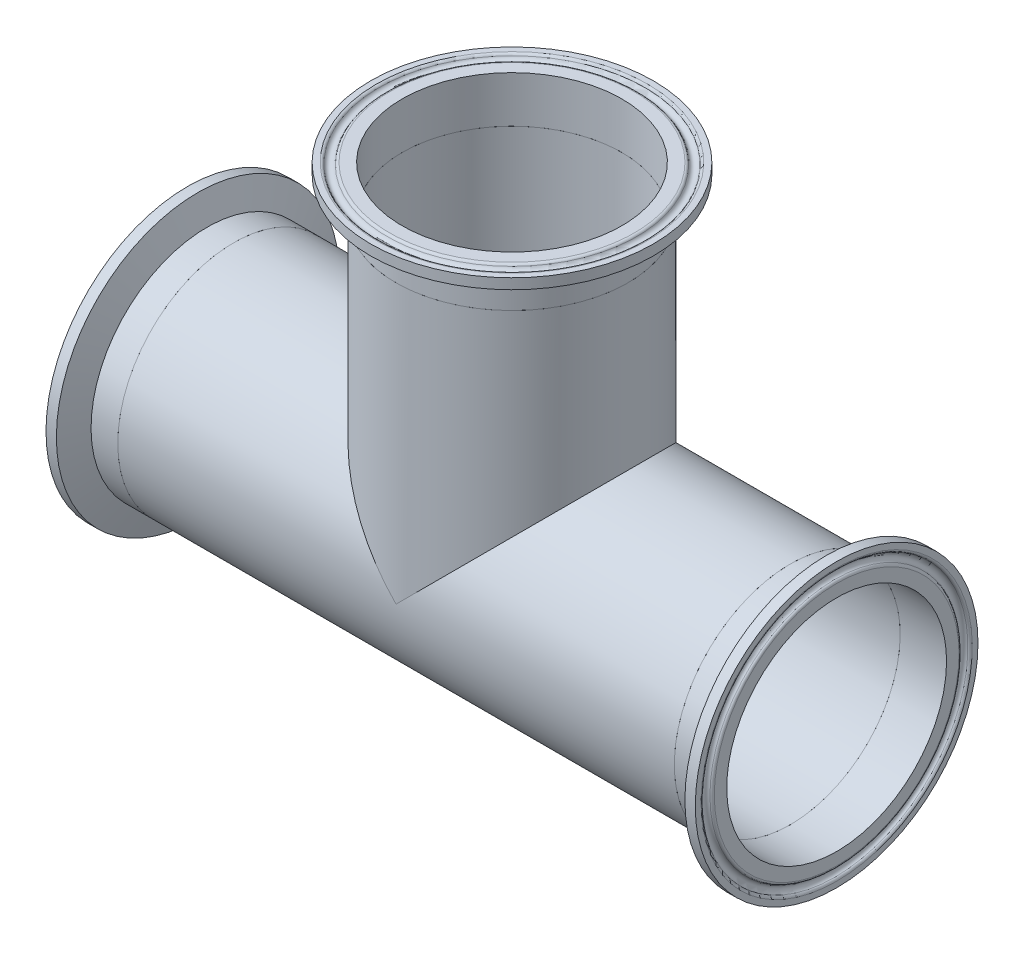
ISO-10303-21;
HEADER;
FILE_DESCRIPTION(('STEP AP214'),'2;1');
FILE_NAME('part.step','',(''),(''),'','','');
FILE_SCHEMA(('AUTOMOTIVE_DESIGN { 1 0 10303 214 1 1 1 1 }'));
ENDSEC;
DATA;
#1=APPLICATION_CONTEXT('core data for automotive mechanical design processes');
#2=APPLICATION_PROTOCOL_DEFINITION('international standard','automotive_design',2000,#1);
#3=PRODUCT_CONTEXT('',#1,'mechanical');
#4=PRODUCT('Part','Part','',(#3));
#5=PRODUCT_RELATED_PRODUCT_CATEGORY('part','',(#4));
#6=PRODUCT_DEFINITION_FORMATION('','',#4);
#7=PRODUCT_DEFINITION_CONTEXT('part definition',#1,'design');
#8=PRODUCT_DEFINITION('design','',#6,#7);
#9=PRODUCT_DEFINITION_SHAPE('','',#8);
#10=(LENGTH_UNIT() NAMED_UNIT(*) SI_UNIT(.MILLI.,.METRE.));
#11=(NAMED_UNIT(*) PLANE_ANGLE_UNIT() SI_UNIT($,.RADIAN.));
#12=(NAMED_UNIT(*) SI_UNIT($,.STERADIAN.) SOLID_ANGLE_UNIT());
#13=UNCERTAINTY_MEASURE_WITH_UNIT(LENGTH_MEASURE(1.E-05),#10,'distance_accuracy_value','');
#14=(GEOMETRIC_REPRESENTATION_CONTEXT(3) GLOBAL_UNCERTAINTY_ASSIGNED_CONTEXT((#13)) GLOBAL_UNIT_ASSIGNED_CONTEXT((#10,
#11,#12)) REPRESENTATION_CONTEXT('',''));
#15=CARTESIAN_POINT('',(0.,0.,0.));
#16=DIRECTION('',(0.,0.,1.));
#17=DIRECTION('',(1.,0.,0.));
#18=AXIS2_PLACEMENT_3D('',#15,#16,#17);
#19=CARTESIAN_POINT('',(47.9033136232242,153.550858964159,131.294687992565));
#20=DIRECTION('',(0.,1.00000000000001,0.));
#21=DIRECTION('',(-0.631074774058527,0.,-0.775722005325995));
#22=AXIS2_PLACEMENT_3D('',#19,#20,#21);
#23=TOROIDAL_SURFACE('',#22,37.1367084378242,0.787400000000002);
#24=CARTESIAN_POINT('',(47.9033136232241,154.33825896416,131.294687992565));
#25=DIRECTION('',(0.,1.00000000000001,0.));
#26=DIRECTION('',(-0.631074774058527,0.,-0.775722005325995));
#27=AXIS2_PLACEMENT_3D('',#24,#25,#26);
#28=CIRCLE('',#27,37.1367084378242);
#29=CARTESIAN_POINT('',(24.4672737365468,154.33825896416,102.48692605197));
#30=VERTEX_POINT('',#29);
#31=EDGE_CURVE('P0_E48',#30,#30,#28,.T.);
#32=ORIENTED_EDGE('',*,*,#31,.T.);
#33=EDGE_LOOP('',(#32));
#34=FACE_BOUND('',#33,.T.);
#35=CARTESIAN_POINT('',(47.9033136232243,153.863799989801,131.294687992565));
#36=DIRECTION('',(0.,1.00000000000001,0.));
#37=DIRECTION('',(-0.631074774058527,0.,-0.775722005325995));
#38=AXIS2_PLACEMENT_3D('',#35,#36,#37);
#39=CIRCLE('',#38,36.4141666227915);
#40=CARTESIAN_POINT('',(24.9232516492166,153.863799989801,103.047417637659));
#41=VERTEX_POINT('',#40);
#42=EDGE_CURVE('P0_E9',#41,#41,#39,.T.);
#43=ORIENTED_EDGE('',*,*,#42,.F.);
#44=EDGE_LOOP('',(#43));
#45=FACE_BOUND('',#44,.T.);
#46=ADVANCED_FACE('P0_F14',(#34,#45),#23,.T.);
#47=CARTESIAN_POINT('',(47.9033136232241,154.33825896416,131.294687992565));
#48=DIRECTION('',(0.,1.00000000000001,0.));
#49=DIRECTION('',(-0.631074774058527,0.,-0.775722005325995));
#50=AXIS2_PLACEMENT_3D('',#47,#48,#49);
#51=TOROIDAL_SURFACE('',#50,35.3187,1.1938);
#52=CARTESIAN_POINT('',(47.9033136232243,153.863799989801,131.294687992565));
#53=DIRECTION('',(0.,1.00000000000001,0.));
#54=DIRECTION('',(-0.631074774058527,0.,-0.775722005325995));
#55=AXIS2_PLACEMENT_3D('',#52,#53,#54);
#56=CIRCLE('',#55,34.2232333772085);
#57=CARTESIAN_POINT('',(26.3058943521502,153.863799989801,104.746972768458));
#58=VERTEX_POINT('',#57);
#59=EDGE_CURVE('P0_E20',#58,#58,#56,.T.);
#60=ORIENTED_EDGE('',*,*,#59,.F.);
#61=EDGE_LOOP('',(#60));
#62=FACE_BOUND('',#61,.T.);
#63=ORIENTED_EDGE('',*,*,#42,.T.);
#64=EDGE_LOOP('',(#63));
#65=FACE_BOUND('',#64,.T.);
#66=ADVANCED_FACE('P0_F97',(#62,#65),#51,.F.);
#67=CARTESIAN_POINT('',(47.9033136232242,153.550858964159,131.294687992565));
#68=DIRECTION('',(0.,1.00000000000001,0.));
#69=DIRECTION('',(-0.631074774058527,0.,-0.775722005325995));
#70=AXIS2_PLACEMENT_3D('',#67,#68,#69);
#71=TOROIDAL_SURFACE('',#70,33.5006915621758,0.787399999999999);
#72=ORIENTED_EDGE('',*,*,#59,.T.);
#73=EDGE_LOOP('',(#72));
#74=FACE_BOUND('',#73,.T.);
#75=CARTESIAN_POINT('',(47.9033136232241,154.33825896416,131.294687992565));
#76=DIRECTION('',(0.,1.00000000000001,0.));
#77=DIRECTION('',(-0.631074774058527,0.,-0.775722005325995));
#78=AXIS2_PLACEMENT_3D('',#75,#76,#77);
#79=CIRCLE('',#78,33.5006915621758);
#80=CARTESIAN_POINT('',(26.7618722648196,154.33825896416,105.307464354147));
#81=VERTEX_POINT('',#80);
#82=EDGE_CURVE('P0_E24',#81,#81,#79,.T.);
#83=ORIENTED_EDGE('',*,*,#82,.F.);
#84=EDGE_LOOP('',(#83));
#85=FACE_BOUND('',#84,.T.);
#86=ADVANCED_FACE('P0_F93',(#74,#85),#71,.T.);
#87=CARTESIAN_POINT('',(47.9033136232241,154.33825896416,131.294687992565));
#88=DIRECTION('',(0.,-1.00000000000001,0.));
#89=DIRECTION('',(0.631074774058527,0.,0.775722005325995));
#90=AXIS2_PLACEMENT_3D('',#87,#88,#89);
#91=PLANE('',#90);
#92=CARTESIAN_POINT('',(47.9033136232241,154.33825896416,131.294687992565));
#93=DIRECTION('',(0.,1.00000000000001,0.));
#94=DIRECTION('',(-0.631074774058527,0.,-0.775722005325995));
#95=AXIS2_PLACEMENT_3D('',#92,#93,#94);
#96=CIRCLE('',#95,30.099);
#97=CARTESIAN_POINT('',(28.9085939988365,154.33825896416,107.946231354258));
#98=VERTEX_POINT('',#97);
#99=EDGE_CURVE('P0_E28',#98,#98,#96,.T.);
#100=ORIENTED_EDGE('',*,*,#99,.F.);
#101=EDGE_LOOP('',(#100));
#102=FACE_BOUND('',#101,.T.);
#103=ORIENTED_EDGE('',*,*,#82,.T.);
#104=EDGE_LOOP('',(#103));
#105=FACE_BOUND('',#104,.T.);
#106=ADVANCED_FACE('P0_F86',(#102,#105),#91,.F.);
#107=CARTESIAN_POINT('',(47.9033136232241,154.33825896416,131.294687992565));
#108=DIRECTION('',(0.,1.00000000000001,0.));
#109=DIRECTION('',(-0.631074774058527,0.,-0.775722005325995));
#110=AXIS2_PLACEMENT_3D('',#107,#108,#109);
#111=CYLINDRICAL_SURFACE('',#110,30.099);
#112=ORIENTED_EDGE('',*,*,#99,.T.);
#113=EDGE_LOOP('',(#112));
#114=FACE_BOUND('',#113,.T.);
#115=CARTESIAN_POINT('',(47.9033136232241,141.638258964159,131.294687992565));
#116=DIRECTION('',(0.,1.00000000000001,0.));
#117=DIRECTION('',(-0.631074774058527,0.,-0.775722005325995));
#118=AXIS2_PLACEMENT_3D('',#115,#116,#117);
#119=CIRCLE('',#118,30.099);
#120=CARTESIAN_POINT('',(28.9085939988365,141.63825896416,107.946231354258));
#121=VERTEX_POINT('',#120);
#122=EDGE_CURVE('P0_E33',#121,#121,#119,.T.);
#123=ORIENTED_EDGE('',*,*,#122,.F.);
#124=EDGE_LOOP('',(#123));
#125=FACE_BOUND('',#124,.T.);
#126=ADVANCED_FACE('P0_F81',(#114,#125),#111,.F.);
#127=CARTESIAN_POINT('',(47.9033136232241,141.638258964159,131.294687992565));
#128=DIRECTION('',(0.,1.00000000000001,0.));
#129=DIRECTION('',(-0.631074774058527,0.,-0.775722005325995));
#130=AXIS2_PLACEMENT_3D('',#127,#128,#129);
#131=PLANE('',#130);
#132=CARTESIAN_POINT('',(47.9033136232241,141.638258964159,131.294687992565));
#133=DIRECTION('',(0.,1.00000000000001,0.));
#134=DIRECTION('',(-0.631074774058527,0.,-0.775722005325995));
#135=AXIS2_PLACEMENT_3D('',#132,#133,#134);
#136=CIRCLE('',#135,31.75);
#137=CARTESIAN_POINT('',(27.8666895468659,141.63825896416,106.665514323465));
#138=VERTEX_POINT('',#137);
#139=EDGE_CURVE('P0_E36',#138,#138,#136,.T.);
#140=ORIENTED_EDGE('',*,*,#139,.F.);
#141=EDGE_LOOP('',(#140));
#142=FACE_BOUND('',#141,.T.);
#143=ORIENTED_EDGE('',*,*,#122,.T.);
#144=EDGE_LOOP('',(#143));
#145=FACE_BOUND('',#144,.T.);
#146=ADVANCED_FACE('P0_F75',(#142,#145),#131,.F.);
#147=CARTESIAN_POINT('',(47.9033136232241,154.33825896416,131.294687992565));
#148=DIRECTION('',(0.,1.00000000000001,0.));
#149=DIRECTION('',(-0.631074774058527,0.,-0.775722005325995));
#150=AXIS2_PLACEMENT_3D('',#147,#148,#149);
#151=CYLINDRICAL_SURFACE('',#150,31.75);
#152=CARTESIAN_POINT('',(47.903313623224,148.96037172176,131.294687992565));
#153=DIRECTION('',(0.,1.00000000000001,0.));
#154=DIRECTION('',(-0.631074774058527,0.,-0.775722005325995));
#155=AXIS2_PLACEMENT_3D('',#152,#153,#154);
#156=CIRCLE('',#155,31.75);
#157=CARTESIAN_POINT('',(27.8666895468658,148.96037172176,106.665514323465));
#158=VERTEX_POINT('',#157);
#159=EDGE_CURVE('P0_E39',#158,#158,#156,.T.);
#160=ORIENTED_EDGE('',*,*,#159,.F.);
#161=EDGE_LOOP('',(#160));
#162=FACE_BOUND('',#161,.T.);
#163=ORIENTED_EDGE('',*,*,#139,.T.);
#164=EDGE_LOOP('',(#163));
#165=FACE_BOUND('',#164,.T.);
#166=ADVANCED_FACE('P0_F69',(#162,#165),#151,.T.);
#167=CARTESIAN_POINT('',(47.903313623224,148.96037172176,131.294687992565));
#168=DIRECTION('',(0.,1.00000000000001,0.));
#169=DIRECTION('',(-0.631074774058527,0.,-0.775722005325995));
#170=AXIS2_PLACEMENT_3D('',#167,#168,#169);
#171=CONICAL_SURFACE('',#170,31.75,1.22173047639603);
#172=CARTESIAN_POINT('',(47.9033136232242,151.493458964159,131.294687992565));
#173=DIRECTION('',(0.,1.00000000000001,0.));
#174=DIRECTION('',(-0.631074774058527,0.,-0.775722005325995));
#175=AXIS2_PLACEMENT_3D('',#172,#173,#174);
#176=CIRCLE('',#175,38.7096);
#177=CARTESIAN_POINT('',(23.4746615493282,151.49345896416,101.266799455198));
#178=VERTEX_POINT('',#177);
#179=EDGE_CURVE('P0_E42',#178,#178,#176,.T.);
#180=ORIENTED_EDGE('',*,*,#179,.F.);
#181=EDGE_LOOP('',(#180));
#182=FACE_BOUND('',#181,.T.);
#183=ORIENTED_EDGE('',*,*,#159,.T.);
#184=EDGE_LOOP('',(#183));
#185=FACE_BOUND('',#184,.T.);
#186=ADVANCED_FACE('P0_F63',(#182,#185),#171,.T.);
#187=CARTESIAN_POINT('',(47.9033136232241,154.33825896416,131.294687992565));
#188=DIRECTION('',(0.,1.00000000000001,0.));
#189=DIRECTION('',(-0.631074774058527,0.,-0.775722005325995));
#190=AXIS2_PLACEMENT_3D('',#187,#188,#189);
#191=CYLINDRICAL_SURFACE('',#190,38.7096);
#192=CARTESIAN_POINT('',(47.9033136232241,154.33825896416,131.294687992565));
#193=DIRECTION('',(0.,1.00000000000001,0.));
#194=DIRECTION('',(-0.631074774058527,0.,-0.775722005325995));
#195=AXIS2_PLACEMENT_3D('',#192,#193,#194);
#196=CIRCLE('',#195,38.7096);
#197=CARTESIAN_POINT('',(23.4746615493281,154.33825896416,101.266799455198));
#198=VERTEX_POINT('',#197);
#199=EDGE_CURVE('P0_E45',#198,#198,#196,.T.);
#200=ORIENTED_EDGE('',*,*,#199,.F.);
#201=EDGE_LOOP('',(#200));
#202=FACE_BOUND('',#201,.T.);
#203=ORIENTED_EDGE('',*,*,#179,.T.);
#204=EDGE_LOOP('',(#203));
#205=FACE_BOUND('',#204,.T.);
#206=ADVANCED_FACE('P0_F57',(#202,#205),#191,.T.);
#207=CARTESIAN_POINT('',(47.9033136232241,154.33825896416,131.294687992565));
#208=DIRECTION('',(0.,-1.00000000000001,0.));
#209=DIRECTION('',(0.631074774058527,0.,0.775722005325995));
#210=AXIS2_PLACEMENT_3D('',#207,#208,#209);
#211=PLANE('',#210);
#212=ORIENTED_EDGE('',*,*,#31,.F.);
#213=EDGE_LOOP('',(#212));
#214=FACE_BOUND('',#213,.T.);
#215=ORIENTED_EDGE('',*,*,#199,.T.);
#216=EDGE_LOOP('',(#215));
#217=FACE_BOUND('',#216,.T.);
#218=ADVANCED_FACE('P0_F54',(#214,#217),#211,.F.);
#219=CLOSED_SHELL('',(#46,#66,#86,#106,#126,#146,#166,#186,#206,#218));
#220=MANIFOLD_SOLID_BREP('P0_B1',#219);
#221=CARTESIAN_POINT('',(136.015913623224,65.4382589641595,131.294687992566));
#222=DIRECTION('',(1.00000000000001,0.,0.));
#223=DIRECTION('',(0.,-0.994854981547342,0.101309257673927));
#224=AXIS2_PLACEMENT_3D('',#221,#222,#223);
#225=TOROIDAL_SURFACE('',#224,37.1367084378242,0.787400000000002);
#226=CARTESIAN_POINT('',(136.803313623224,65.4382589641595,131.294687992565));
#227=DIRECTION('',(1.00000000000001,0.,0.));
#228=DIRECTION('',(0.,-0.994854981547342,0.101309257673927));
#229=AXIS2_PLACEMENT_3D('',#226,#227,#228);
#230=CIRCLE('',#229,37.1367084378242);
#231=CARTESIAN_POINT('',(136.803313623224,28.4926195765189,135.056980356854));
#232=VERTEX_POINT('',#231);
#233=EDGE_CURVE('P1_E49',#232,#232,#230,.T.);
#234=ORIENTED_EDGE('',*,*,#233,.T.);
#235=EDGE_LOOP('',(#234));
#236=FACE_BOUND('',#235,.T.);
#237=CARTESIAN_POINT('',(136.328854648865,65.4382589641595,131.294687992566));
#238=DIRECTION('',(1.00000000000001,0.,0.));
#239=DIRECTION('',(0.,-0.994854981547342,0.101309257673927));
#240=AXIS2_PLACEMENT_3D('',#237,#238,#239);
#241=CIRCLE('',#240,36.4141666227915);
#242=CARTESIAN_POINT('',(136.328854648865,29.2114439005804,134.983780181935));
#243=VERTEX_POINT('',#242);
#244=EDGE_CURVE('P1_E10',#243,#243,#241,.T.);
#245=ORIENTED_EDGE('',*,*,#244,.F.);
#246=EDGE_LOOP('',(#245));
#247=FACE_BOUND('',#246,.T.);
#248=ADVANCED_FACE('P1_F15',(#236,#247),#225,.T.);
#249=CARTESIAN_POINT('',(136.803313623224,65.4382589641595,131.294687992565));
#250=DIRECTION('',(1.00000000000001,0.,0.));
#251=DIRECTION('',(0.,-0.994854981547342,0.101309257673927));
#252=AXIS2_PLACEMENT_3D('',#249,#250,#251);
#253=TOROIDAL_SURFACE('',#252,35.3187,1.1938);
#254=CARTESIAN_POINT('',(136.328854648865,65.4382589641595,131.294687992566));
#255=DIRECTION('',(1.00000000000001,0.,0.));
#256=DIRECTION('',(0.,-0.994854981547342,0.101309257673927));
#257=AXIS2_PLACEMENT_3D('',#254,#255,#256);
#258=CIRCLE('',#257,34.2232333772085);
#259=CARTESIAN_POINT('',(136.328854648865,31.3911047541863,134.761818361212));
#260=VERTEX_POINT('',#259);
#261=EDGE_CURVE('P1_E21',#260,#260,#258,.T.);
#262=ORIENTED_EDGE('',*,*,#261,.F.);
#263=EDGE_LOOP('',(#262));
#264=FACE_BOUND('',#263,.T.);
#265=ORIENTED_EDGE('',*,*,#244,.T.);
#266=EDGE_LOOP('',(#265));
#267=FACE_BOUND('',#266,.T.);
#268=ADVANCED_FACE('P1_F98',(#264,#267),#253,.F.);
#269=CARTESIAN_POINT('',(136.015913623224,65.4382589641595,131.294687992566));
#270=DIRECTION('',(1.00000000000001,0.,0.));
#271=DIRECTION('',(0.,-0.994854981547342,0.101309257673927));
#272=AXIS2_PLACEMENT_3D('',#269,#270,#271);
#273=TOROIDAL_SURFACE('',#272,33.5006915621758,0.787399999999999);
#274=ORIENTED_EDGE('',*,*,#261,.T.);
#275=EDGE_LOOP('',(#274));
#276=FACE_BOUND('',#275,.T.);
#277=CARTESIAN_POINT('',(136.803313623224,65.4382589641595,131.294687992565));
#278=DIRECTION('',(1.00000000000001,0.,0.));
#279=DIRECTION('',(0.,-0.994854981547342,0.101309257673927));
#280=AXIS2_PLACEMENT_3D('',#277,#278,#279);
#281=CIRCLE('',#280,33.5006915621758);
#282=CARTESIAN_POINT('',(136.803313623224,32.1099290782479,134.688618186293));
#283=VERTEX_POINT('',#282);
#284=EDGE_CURVE('P1_E25',#283,#283,#281,.T.);
#285=ORIENTED_EDGE('',*,*,#284,.F.);
#286=EDGE_LOOP('',(#285));
#287=FACE_BOUND('',#286,.T.);
#288=ADVANCED_FACE('P1_F94',(#276,#287),#273,.T.);
#289=CARTESIAN_POINT('',(136.803313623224,65.4382589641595,131.294687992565));
#290=DIRECTION('',(-1.00000000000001,0.,0.));
#291=DIRECTION('',(0.,0.994854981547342,-0.101309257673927));
#292=AXIS2_PLACEMENT_3D('',#289,#290,#291);
#293=PLANE('',#292);
#294=CARTESIAN_POINT('',(136.803313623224,65.4382589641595,131.294687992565));
#295=DIRECTION('',(1.00000000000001,0.,0.));
#296=DIRECTION('',(0.,-0.994854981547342,0.101309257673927));
#297=AXIS2_PLACEMENT_3D('',#294,#295,#296);
#298=CIRCLE('',#297,30.099);
#299=CARTESIAN_POINT('',(136.803313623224,35.494118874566,134.343995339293));
#300=VERTEX_POINT('',#299);
#301=EDGE_CURVE('P1_E29',#300,#300,#298,.T.);
#302=ORIENTED_EDGE('',*,*,#301,.F.);
#303=EDGE_LOOP('',(#302));
#304=FACE_BOUND('',#303,.T.);
#305=ORIENTED_EDGE('',*,*,#284,.T.);
#306=EDGE_LOOP('',(#305));
#307=FACE_BOUND('',#306,.T.);
#308=ADVANCED_FACE('P1_F87',(#304,#307),#293,.F.);
#309=CARTESIAN_POINT('',(136.803313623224,65.4382589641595,131.294687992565));
#310=DIRECTION('',(1.00000000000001,0.,0.));
#311=DIRECTION('',(0.,-0.994854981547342,0.101309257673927));
#312=AXIS2_PLACEMENT_3D('',#309,#310,#311);
#313=CYLINDRICAL_SURFACE('',#312,30.099);
#314=ORIENTED_EDGE('',*,*,#301,.T.);
#315=EDGE_LOOP('',(#314));
#316=FACE_BOUND('',#315,.T.);
#317=CARTESIAN_POINT('',(124.103313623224,65.4382589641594,131.294687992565));
#318=DIRECTION('',(1.00000000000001,0.,0.));
#319=DIRECTION('',(0.,-0.994854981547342,0.101309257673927));
#320=AXIS2_PLACEMENT_3D('',#317,#318,#319);
#321=CIRCLE('',#320,30.099);
#322=CARTESIAN_POINT('',(124.103313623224,35.494118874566,134.343995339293));
#323=VERTEX_POINT('',#322);
#324=EDGE_CURVE('P1_E34',#323,#323,#321,.T.);
#325=ORIENTED_EDGE('',*,*,#324,.F.);
#326=EDGE_LOOP('',(#325));
#327=FACE_BOUND('',#326,.T.);
#328=ADVANCED_FACE('P1_F82',(#316,#327),#313,.F.);
#329=CARTESIAN_POINT('',(124.103313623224,65.4382589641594,131.294687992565));
#330=DIRECTION('',(1.00000000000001,0.,0.));
#331=DIRECTION('',(0.,-0.994854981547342,0.101309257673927));
#332=AXIS2_PLACEMENT_3D('',#329,#330,#331);
#333=PLANE('',#332);
#334=CARTESIAN_POINT('',(124.103313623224,65.4382589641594,131.294687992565));
#335=DIRECTION('',(1.00000000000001,0.,0.));
#336=DIRECTION('',(0.,-0.994854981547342,0.101309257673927));
#337=AXIS2_PLACEMENT_3D('',#334,#335,#336);
#338=CIRCLE('',#337,31.75);
#339=CARTESIAN_POINT('',(124.103313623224,33.8516133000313,134.511256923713));
#340=VERTEX_POINT('',#339);
#341=EDGE_CURVE('P1_E37',#340,#340,#338,.T.);
#342=ORIENTED_EDGE('',*,*,#341,.F.);
#343=EDGE_LOOP('',(#342));
#344=FACE_BOUND('',#343,.T.);
#345=ORIENTED_EDGE('',*,*,#324,.T.);
#346=EDGE_LOOP('',(#345));
#347=FACE_BOUND('',#346,.T.);
#348=ADVANCED_FACE('P1_F76',(#344,#347),#333,.F.);
#349=CARTESIAN_POINT('',(136.803313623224,65.4382589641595,131.294687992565));
#350=DIRECTION('',(1.00000000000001,0.,0.));
#351=DIRECTION('',(0.,-0.994854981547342,0.101309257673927));
#352=AXIS2_PLACEMENT_3D('',#349,#350,#351);
#353=CYLINDRICAL_SURFACE('',#352,31.75);
#354=CARTESIAN_POINT('',(131.425426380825,65.4382589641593,131.294687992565));
#355=DIRECTION('',(1.00000000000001,0.,0.));
#356=DIRECTION('',(0.,-0.994854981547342,0.101309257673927));
#357=AXIS2_PLACEMENT_3D('',#354,#355,#356);
#358=CIRCLE('',#357,31.75);
#359=CARTESIAN_POINT('',(131.425426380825,33.8516133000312,134.511256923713));
#360=VERTEX_POINT('',#359);
#361=EDGE_CURVE('P1_E40',#360,#360,#358,.T.);
#362=ORIENTED_EDGE('',*,*,#361,.F.);
#363=EDGE_LOOP('',(#362));
#364=FACE_BOUND('',#363,.T.);
#365=ORIENTED_EDGE('',*,*,#341,.T.);
#366=EDGE_LOOP('',(#365));
#367=FACE_BOUND('',#366,.T.);
#368=ADVANCED_FACE('P1_F70',(#364,#367),#353,.T.);
#369=CARTESIAN_POINT('',(131.425426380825,65.4382589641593,131.294687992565));
#370=DIRECTION('',(1.00000000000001,0.,0.));
#371=DIRECTION('',(0.,-0.994854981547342,0.101309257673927));
#372=AXIS2_PLACEMENT_3D('',#369,#370,#371);
#373=CONICAL_SURFACE('',#372,31.75,1.22173047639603);
#374=CARTESIAN_POINT('',(133.958513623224,65.4382589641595,131.294687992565));
#375=DIRECTION('',(1.00000000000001,0.,0.));
#376=DIRECTION('',(0.,-0.994854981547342,0.101309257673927));
#377=AXIS2_PLACEMENT_3D('',#374,#375,#376);
#378=CIRCLE('',#377,38.7096);
#379=CARTESIAN_POINT('',(133.958513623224,26.9278205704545,135.21632883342));
#380=VERTEX_POINT('',#379);
#381=EDGE_CURVE('P1_E43',#380,#380,#378,.T.);
#382=ORIENTED_EDGE('',*,*,#381,.F.);
#383=EDGE_LOOP('',(#382));
#384=FACE_BOUND('',#383,.T.);
#385=ORIENTED_EDGE('',*,*,#361,.T.);
#386=EDGE_LOOP('',(#385));
#387=FACE_BOUND('',#386,.T.);
#388=ADVANCED_FACE('P1_F64',(#384,#387),#373,.T.);
#389=CARTESIAN_POINT('',(136.803313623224,65.4382589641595,131.294687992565));
#390=DIRECTION('',(1.00000000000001,0.,0.));
#391=DIRECTION('',(0.,-0.994854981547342,0.101309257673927));
#392=AXIS2_PLACEMENT_3D('',#389,#390,#391);
#393=CYLINDRICAL_SURFACE('',#392,38.7096);
#394=CARTESIAN_POINT('',(136.803313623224,65.4382589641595,131.294687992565));
#395=DIRECTION('',(1.00000000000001,0.,0.));
#396=DIRECTION('',(0.,-0.994854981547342,0.101309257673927));
#397=AXIS2_PLACEMENT_3D('',#394,#395,#396);
#398=CIRCLE('',#397,38.7096);
#399=CARTESIAN_POINT('',(136.803313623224,26.9278205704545,135.21632883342));
#400=VERTEX_POINT('',#399);
#401=EDGE_CURVE('P1_E46',#400,#400,#398,.T.);
#402=ORIENTED_EDGE('',*,*,#401,.F.);
#403=EDGE_LOOP('',(#402));
#404=FACE_BOUND('',#403,.T.);
#405=ORIENTED_EDGE('',*,*,#381,.T.);
#406=EDGE_LOOP('',(#405));
#407=FACE_BOUND('',#406,.T.);
#408=ADVANCED_FACE('P1_F58',(#404,#407),#393,.T.);
#409=CARTESIAN_POINT('',(136.803313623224,65.4382589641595,131.294687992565));
#410=DIRECTION('',(-1.00000000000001,0.,0.));
#411=DIRECTION('',(0.,0.994854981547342,-0.101309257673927));
#412=AXIS2_PLACEMENT_3D('',#409,#410,#411);
#413=PLANE('',#412);
#414=ORIENTED_EDGE('',*,*,#233,.F.);
#415=EDGE_LOOP('',(#414));
#416=FACE_BOUND('',#415,.T.);
#417=ORIENTED_EDGE('',*,*,#401,.T.);
#418=EDGE_LOOP('',(#417));
#419=FACE_BOUND('',#418,.T.);
#420=ADVANCED_FACE('P1_F55',(#416,#419),#413,.F.);
#421=CLOSED_SHELL('',(#248,#268,#288,#308,#328,#348,#368,#388,#408,#420));
#422=MANIFOLD_SOLID_BREP('P1_B1',#421);
#423=CARTESIAN_POINT('',(-40.2092863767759,65.4382589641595,131.294687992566));
#424=DIRECTION('',(-1.00000000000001,0.,0.));
#425=DIRECTION('',(0.,0.69756414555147,-0.716522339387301));
#426=AXIS2_PLACEMENT_3D('',#423,#424,#425);
#427=TOROIDAL_SURFACE('',#426,37.1367084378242,0.787400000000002);
#428=CARTESIAN_POINT('',(-40.996686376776,65.4382589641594,131.294687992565));
#429=DIRECTION('',(-1.00000000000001,0.,0.));
#430=DIRECTION('',(0.,0.69756414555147,-0.716522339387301));
#431=AXIS2_PLACEMENT_3D('',#428,#429,#430);
#432=CIRCLE('',#431,37.1367084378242);
#433=CARTESIAN_POINT('',(-40.9966863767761,91.3434952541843,104.685406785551));
#434=VERTEX_POINT('',#433);
#435=EDGE_CURVE('P2_E49',#434,#434,#432,.T.);
#436=ORIENTED_EDGE('',*,*,#435,.T.);
#437=EDGE_LOOP('',(#436));
#438=FACE_BOUND('',#437,.T.);
#439=CARTESIAN_POINT('',(-40.522227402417,65.4382589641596,131.294687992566));
#440=DIRECTION('',(-1.00000000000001,0.,0.));
#441=DIRECTION('',(0.,0.69756414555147,-0.716522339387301));
#442=AXIS2_PLACEMENT_3D('',#439,#440,#441);
#443=CIRCLE('',#442,36.4141666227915);
#444=CARTESIAN_POINT('',(-40.5222274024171,90.839475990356,105.203124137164));
#445=VERTEX_POINT('',#444);
#446=EDGE_CURVE('P2_E10',#445,#445,#443,.T.);
#447=ORIENTED_EDGE('',*,*,#446,.F.);
#448=EDGE_LOOP('',(#447));
#449=FACE_BOUND('',#448,.T.);
#450=ADVANCED_FACE('P2_F15',(#438,#449),#427,.T.);
#451=CARTESIAN_POINT('',(-40.996686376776,65.4382589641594,131.294687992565));
#452=DIRECTION('',(-1.00000000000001,0.,0.));
#453=DIRECTION('',(0.,0.69756414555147,-0.716522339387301));
#454=AXIS2_PLACEMENT_3D('',#451,#452,#453);
#455=TOROIDAL_SURFACE('',#454,35.3187,1.1938);
#456=CARTESIAN_POINT('',(-40.522227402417,65.4382589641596,131.294687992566));
#457=DIRECTION('',(-1.00000000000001,0.,0.));
#458=DIRECTION('',(0.,0.69756414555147,-0.716522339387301));
#459=AXIS2_PLACEMENT_3D('',#456,#457,#458);
#460=CIRCLE('',#459,34.2232333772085);
#461=CARTESIAN_POINT('',(-40.5222274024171,89.3111595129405,106.772976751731));
#462=VERTEX_POINT('',#461);
#463=EDGE_CURVE('P2_E21',#462,#462,#460,.T.);
#464=ORIENTED_EDGE('',*,*,#463,.F.);
#465=EDGE_LOOP('',(#464));
#466=FACE_BOUND('',#465,.T.);
#467=ORIENTED_EDGE('',*,*,#446,.T.);
#468=EDGE_LOOP('',(#467));
#469=FACE_BOUND('',#468,.T.);
#470=ADVANCED_FACE('P2_F98',(#466,#469),#455,.F.);
#471=CARTESIAN_POINT('',(-40.2092863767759,65.4382589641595,131.294687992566));
#472=DIRECTION('',(-1.00000000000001,0.,0.));
#473=DIRECTION('',(0.,0.69756414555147,-0.716522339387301));
#474=AXIS2_PLACEMENT_3D('',#471,#472,#473);
#475=TOROIDAL_SURFACE('',#474,33.5006915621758,0.787399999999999);
#476=ORIENTED_EDGE('',*,*,#463,.T.);
#477=EDGE_LOOP('',(#476));
#478=FACE_BOUND('',#477,.T.);
#479=CARTESIAN_POINT('',(-40.996686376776,65.4382589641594,131.294687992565));
#480=DIRECTION('',(-1.00000000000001,0.,0.));
#481=DIRECTION('',(0.,0.69756414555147,-0.716522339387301));
#482=AXIS2_PLACEMENT_3D('',#479,#480,#481);
#483=CIRCLE('',#482,33.5006915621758);
#484=CARTESIAN_POINT('',(-40.9966863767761,88.8071402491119,107.290694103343));
#485=VERTEX_POINT('',#484);
#486=EDGE_CURVE('P2_E25',#485,#485,#483,.T.);
#487=ORIENTED_EDGE('',*,*,#486,.F.);
#488=EDGE_LOOP('',(#487));
#489=FACE_BOUND('',#488,.T.);
#490=ADVANCED_FACE('P2_F94',(#478,#489),#475,.T.);
#491=CARTESIAN_POINT('',(-40.996686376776,65.4382589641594,131.294687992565));
#492=DIRECTION('',(1.00000000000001,0.,0.));
#493=DIRECTION('',(0.,-0.69756414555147,0.716522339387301));
#494=AXIS2_PLACEMENT_3D('',#491,#492,#493);
#495=PLANE('',#494);
#496=CARTESIAN_POINT('',(-40.996686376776,65.4382589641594,131.294687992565));
#497=DIRECTION('',(-1.00000000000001,0.,0.));
#498=DIRECTION('',(0.,0.69756414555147,-0.716522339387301));
#499=AXIS2_PLACEMENT_3D('',#496,#497,#498);
#500=CIRCLE('',#499,30.099);
#501=CARTESIAN_POINT('',(-40.9966863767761,86.4342421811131,109.728082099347));
#502=VERTEX_POINT('',#501);
#503=EDGE_CURVE('P2_E29',#502,#502,#500,.T.);
#504=ORIENTED_EDGE('',*,*,#503,.F.);
#505=EDGE_LOOP('',(#504));
#506=FACE_BOUND('',#505,.T.);
#507=ORIENTED_EDGE('',*,*,#486,.T.);
#508=EDGE_LOOP('',(#507));
#509=FACE_BOUND('',#508,.T.);
#510=ADVANCED_FACE('P2_F87',(#506,#509),#495,.F.);
#511=CARTESIAN_POINT('',(-40.996686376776,65.4382589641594,131.294687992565));
#512=DIRECTION('',(-1.00000000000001,0.,0.));
#513=DIRECTION('',(0.,0.69756414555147,-0.716522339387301));
#514=AXIS2_PLACEMENT_3D('',#511,#512,#513);
#515=CYLINDRICAL_SURFACE('',#514,30.099);
#516=ORIENTED_EDGE('',*,*,#503,.T.);
#517=EDGE_LOOP('',(#516));
#518=FACE_BOUND('',#517,.T.);
#519=CARTESIAN_POINT('',(-28.2966863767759,65.4382589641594,131.294687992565));
#520=DIRECTION('',(-1.00000000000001,0.,0.));
#521=DIRECTION('',(0.,0.69756414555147,-0.716522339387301));
#522=AXIS2_PLACEMENT_3D('',#519,#520,#521);
#523=CIRCLE('',#522,30.099);
#524=CARTESIAN_POINT('',(-28.2966863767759,86.4342421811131,109.728082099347));
#525=VERTEX_POINT('',#524);
#526=EDGE_CURVE('P2_E34',#525,#525,#523,.T.);
#527=ORIENTED_EDGE('',*,*,#526,.F.);
#528=EDGE_LOOP('',(#527));
#529=FACE_BOUND('',#528,.T.);
#530=ADVANCED_FACE('P2_F82',(#518,#529),#515,.F.);
#531=CARTESIAN_POINT('',(-28.2966863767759,65.4382589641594,131.294687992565));
#532=DIRECTION('',(-1.00000000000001,0.,0.));
#533=DIRECTION('',(0.,0.69756414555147,-0.716522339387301));
#534=AXIS2_PLACEMENT_3D('',#531,#532,#533);
#535=PLANE('',#534);
#536=CARTESIAN_POINT('',(-28.2966863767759,65.4382589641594,131.294687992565));
#537=DIRECTION('',(-1.00000000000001,0.,0.));
#538=DIRECTION('',(0.,0.69756414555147,-0.716522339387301));
#539=AXIS2_PLACEMENT_3D('',#536,#537,#538);
#540=CIRCLE('',#539,31.75);
#541=CARTESIAN_POINT('',(-28.2966863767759,87.5859205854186,108.545103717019));
#542=VERTEX_POINT('',#541);
#543=EDGE_CURVE('P2_E37',#542,#542,#540,.T.);
#544=ORIENTED_EDGE('',*,*,#543,.F.);
#545=EDGE_LOOP('',(#544));
#546=FACE_BOUND('',#545,.T.);
#547=ORIENTED_EDGE('',*,*,#526,.T.);
#548=EDGE_LOOP('',(#547));
#549=FACE_BOUND('',#548,.T.);
#550=ADVANCED_FACE('P2_F76',(#546,#549),#535,.F.);
#551=CARTESIAN_POINT('',(-40.996686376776,65.4382589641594,131.294687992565));
#552=DIRECTION('',(-1.00000000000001,0.,0.));
#553=DIRECTION('',(0.,0.69756414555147,-0.716522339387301));
#554=AXIS2_PLACEMENT_3D('',#551,#552,#553);
#555=CYLINDRICAL_SURFACE('',#554,31.75);
#556=CARTESIAN_POINT('',(-35.6187991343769,65.4382589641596,131.294687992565));
#557=DIRECTION('',(-1.00000000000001,0.,0.));
#558=DIRECTION('',(0.,0.69756414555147,-0.716522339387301));
#559=AXIS2_PLACEMENT_3D('',#556,#557,#558);
#560=CIRCLE('',#559,31.75);
#561=CARTESIAN_POINT('',(-35.6187991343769,87.5859205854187,108.545103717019));
#562=VERTEX_POINT('',#561);
#563=EDGE_CURVE('P2_E40',#562,#562,#560,.T.);
#564=ORIENTED_EDGE('',*,*,#563,.F.);
#565=EDGE_LOOP('',(#564));
#566=FACE_BOUND('',#565,.T.);
#567=ORIENTED_EDGE('',*,*,#543,.T.);
#568=EDGE_LOOP('',(#567));
#569=FACE_BOUND('',#568,.T.);
#570=ADVANCED_FACE('P2_F70',(#566,#569),#555,.T.);
#571=CARTESIAN_POINT('',(-35.6187991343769,65.4382589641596,131.294687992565));
#572=DIRECTION('',(-1.00000000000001,0.,0.));
#573=DIRECTION('',(0.,0.69756414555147,-0.716522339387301));
#574=AXIS2_PLACEMENT_3D('',#571,#572,#573);
#575=CONICAL_SURFACE('',#574,31.75,1.22173047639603);
#576=CARTESIAN_POINT('',(-38.1518863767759,65.4382589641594,131.294687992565));
#577=DIRECTION('',(-1.00000000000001,0.,0.));
#578=DIRECTION('',(0.,0.69756414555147,-0.716522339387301));
#579=AXIS2_PLACEMENT_3D('',#576,#577,#578);
#580=CIRCLE('',#579,38.7096);
#581=CARTESIAN_POINT('',(-38.151886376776,92.4406880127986,103.558394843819));
#582=VERTEX_POINT('',#581);
#583=EDGE_CURVE('P2_E43',#582,#582,#580,.T.);
#584=ORIENTED_EDGE('',*,*,#583,.F.);
#585=EDGE_LOOP('',(#584));
#586=FACE_BOUND('',#585,.T.);
#587=ORIENTED_EDGE('',*,*,#563,.T.);
#588=EDGE_LOOP('',(#587));
#589=FACE_BOUND('',#588,.T.);
#590=ADVANCED_FACE('P2_F64',(#586,#589),#575,.T.);
#591=CARTESIAN_POINT('',(-40.996686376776,65.4382589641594,131.294687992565));
#592=DIRECTION('',(-1.00000000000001,0.,0.));
#593=DIRECTION('',(0.,0.69756414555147,-0.716522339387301));
#594=AXIS2_PLACEMENT_3D('',#591,#592,#593);
#595=CYLINDRICAL_SURFACE('',#594,38.7096);
#596=CARTESIAN_POINT('',(-40.996686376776,65.4382589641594,131.294687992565));
#597=DIRECTION('',(-1.00000000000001,0.,0.));
#598=DIRECTION('',(0.,0.69756414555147,-0.716522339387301));
#599=AXIS2_PLACEMENT_3D('',#596,#597,#598);
#600=CIRCLE('',#599,38.7096);
#601=CARTESIAN_POINT('',(-40.9966863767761,92.4406880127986,103.558394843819));
#602=VERTEX_POINT('',#601);
#603=EDGE_CURVE('P2_E46',#602,#602,#600,.T.);
#604=ORIENTED_EDGE('',*,*,#603,.F.);
#605=EDGE_LOOP('',(#604));
#606=FACE_BOUND('',#605,.T.);
#607=ORIENTED_EDGE('',*,*,#583,.T.);
#608=EDGE_LOOP('',(#607));
#609=FACE_BOUND('',#608,.T.);
#610=ADVANCED_FACE('P2_F58',(#606,#609),#595,.T.);
#611=CARTESIAN_POINT('',(-40.996686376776,65.4382589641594,131.294687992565));
#612=DIRECTION('',(1.00000000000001,0.,0.));
#613=DIRECTION('',(0.,-0.69756414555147,0.716522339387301));
#614=AXIS2_PLACEMENT_3D('',#611,#612,#613);
#615=PLANE('',#614);
#616=ORIENTED_EDGE('',*,*,#435,.F.);
#617=EDGE_LOOP('',(#616));
#618=FACE_BOUND('',#617,.T.);
#619=ORIENTED_EDGE('',*,*,#603,.T.);
#620=EDGE_LOOP('',(#619));
#621=FACE_BOUND('',#620,.T.);
#622=ADVANCED_FACE('P2_F55',(#618,#621),#615,.F.);
#623=CLOSED_SHELL('',(#450,#470,#490,#510,#530,#550,#570,#590,#610,#622));
#624=MANIFOLD_SOLID_BREP('P2_B1',#623);
#625=CARTESIAN_POINT('',(47.9033136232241,141.638258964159,131.294687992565));
#626=DIRECTION('',(0.,-1.,0.));
#627=DIRECTION('',(0.,0.,-1.));
#628=AXIS2_PLACEMENT_3D('',#625,#626,#627);
#629=CYLINDRICAL_SURFACE('',#628,31.75);
#630=CARTESIAN_POINT('',(47.9033136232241,141.638258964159,131.294687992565));
#631=DIRECTION('',(0.,1.,0.));
#632=DIRECTION('',(0.,0.,1.));
#633=AXIS2_PLACEMENT_3D('',#630,#631,#632);
#634=CIRCLE('',#633,31.75);
#635=CARTESIAN_POINT('',(47.9033136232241,141.638258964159,163.044687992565));
#636=VERTEX_POINT('',#635);
#637=EDGE_CURVE('P3_E11',#636,#636,#634,.T.);
#638=ORIENTED_EDGE('',*,*,#637,.F.);
#639=EDGE_LOOP('',(#638));
#640=FACE_BOUND('',#639,.T.);
#641=CARTESIAN_POINT('',(47.9033136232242,65.4382589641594,131.294687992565));
#642=DIRECTION('',(-0.707106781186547,-0.707106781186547,0.));
#643=DIRECTION('',(0.707106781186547,-0.707106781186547,0.));
#644=AXIS2_PLACEMENT_3D('',#641,#642,#643);
#645=ELLIPSE('',#644,44.9012806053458,31.75);
#646=CARTESIAN_POINT('',(47.9033136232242,65.4382589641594,163.044687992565));
#647=VERTEX_POINT('',#646);
#648=CARTESIAN_POINT('',(47.9033136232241,65.4382589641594,99.5446879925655));
#649=VERTEX_POINT('',#648);
#650=EDGE_CURVE('P3_E24',#647,#649,#645,.T.);
#651=ORIENTED_EDGE('',*,*,#650,.F.);
#652=CARTESIAN_POINT('',(47.9033136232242,65.4382589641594,131.294687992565));
#653=DIRECTION('',(0.707106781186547,-0.707106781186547,0.));
#654=DIRECTION('',(-0.707106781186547,-0.707106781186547,0.));
#655=AXIS2_PLACEMENT_3D('',#652,#653,#654);
#656=ELLIPSE('',#655,44.9012806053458,31.75);
#657=EDGE_CURVE('P3_E37',#649,#647,#656,.T.);
#658=ORIENTED_EDGE('',*,*,#657,.F.);
#659=EDGE_LOOP('',(#651,#658));
#660=FACE_BOUND('',#659,.T.);
#661=ADVANCED_FACE('P3_F17',(#640,#660),#629,.T.);
#662=CARTESIAN_POINT('',(47.9033136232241,141.638258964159,131.294687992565));
#663=DIRECTION('',(0.,1.,0.));
#664=DIRECTION('',(0.,0.,1.));
#665=AXIS2_PLACEMENT_3D('',#662,#663,#664);
#666=PLANE('',#665);
#667=CARTESIAN_POINT('',(47.9033136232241,141.638258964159,131.294687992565));
#668=DIRECTION('',(0.,1.,0.));
#669=DIRECTION('',(0.,0.,1.));
#670=AXIS2_PLACEMENT_3D('',#667,#668,#669);
#671=CIRCLE('',#670,30.099);
#672=CARTESIAN_POINT('',(47.9033136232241,141.638258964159,161.393687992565));
#673=VERTEX_POINT('',#672);
#674=EDGE_CURVE('P3_E49',#673,#673,#671,.T.);
#675=ORIENTED_EDGE('',*,*,#674,.F.);
#676=EDGE_LOOP('',(#675));
#677=FACE_BOUND('',#676,.T.);
#678=ORIENTED_EDGE('',*,*,#637,.T.);
#679=EDGE_LOOP('',(#678));
#680=FACE_BOUND('',#679,.T.);
#681=ADVANCED_FACE('P3_F64',(#677,#680),#666,.T.);
#682=CARTESIAN_POINT('',(124.103313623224,65.4382589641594,131.294687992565));
#683=DIRECTION('',(-1.,0.,0.));
#684=DIRECTION('',(0.,0.,1.));
#685=AXIS2_PLACEMENT_3D('',#682,#683,#684);
#686=CYLINDRICAL_SURFACE('',#685,31.75);
#687=CARTESIAN_POINT('',(-28.2966863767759,65.4382589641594,131.294687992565));
#688=DIRECTION('',(1.,0.,0.));
#689=DIRECTION('',(0.,0.,-1.));
#690=AXIS2_PLACEMENT_3D('',#687,#688,#689);
#691=CIRCLE('',#690,31.75);
#692=CARTESIAN_POINT('',(-28.2966863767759,65.4382589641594,99.5446879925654));
#693=VERTEX_POINT('',#692);
#694=EDGE_CURVE('P3_E52',#693,#693,#691,.T.);
#695=ORIENTED_EDGE('',*,*,#694,.T.);
#696=EDGE_LOOP('',(#695));
#697=FACE_BOUND('',#696,.T.);
#698=CARTESIAN_POINT('',(124.103313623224,65.4382589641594,131.294687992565));
#699=DIRECTION('',(1.,0.,0.));
#700=DIRECTION('',(0.,0.,-1.));
#701=AXIS2_PLACEMENT_3D('',#698,#699,#700);
#702=CIRCLE('',#701,31.75);
#703=CARTESIAN_POINT('',(124.103313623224,65.4382589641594,99.5446879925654));
#704=VERTEX_POINT('',#703);
#705=EDGE_CURVE('P3_E56',#704,#704,#702,.T.);
#706=ORIENTED_EDGE('',*,*,#705,.F.);
#707=EDGE_LOOP('',(#706));
#708=FACE_BOUND('',#707,.T.);
#709=ORIENTED_EDGE('',*,*,#657,.T.);
#710=ORIENTED_EDGE('',*,*,#650,.T.);
#711=EDGE_LOOP('',(#709,#710));
#712=FACE_BOUND('',#711,.T.);
#713=ADVANCED_FACE('P3_F62',(#697,#708,#712),#686,.T.);
#714=CARTESIAN_POINT('',(124.103313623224,65.4382589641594,131.294687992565));
#715=DIRECTION('',(1.,0.,0.));
#716=DIRECTION('',(0.,0.,-1.));
#717=AXIS2_PLACEMENT_3D('',#714,#715,#716);
#718=PLANE('',#717);
#719=CARTESIAN_POINT('',(124.103313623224,65.4382589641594,131.294687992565));
#720=DIRECTION('',(1.,0.,0.));
#721=DIRECTION('',(0.,0.,-1.));
#722=AXIS2_PLACEMENT_3D('',#719,#720,#721);
#723=CIRCLE('',#722,30.099);
#724=CARTESIAN_POINT('',(124.103313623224,65.4382589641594,101.195687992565));
#725=VERTEX_POINT('',#724);
#726=EDGE_CURVE('P3_E97',#725,#725,#723,.T.);
#727=ORIENTED_EDGE('',*,*,#726,.F.);
#728=EDGE_LOOP('',(#727));
#729=FACE_BOUND('',#728,.T.);
#730=ORIENTED_EDGE('',*,*,#705,.T.);
#731=EDGE_LOOP('',(#730));
#732=FACE_BOUND('',#731,.T.);
#733=ADVANCED_FACE('P3_F76',(#729,#732),#718,.T.);
#734=CARTESIAN_POINT('',(-28.2966863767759,65.4382589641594,131.294687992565));
#735=DIRECTION('',(1.,0.,0.));
#736=DIRECTION('',(0.,0.,-1.));
#737=AXIS2_PLACEMENT_3D('',#734,#735,#736);
#738=PLANE('',#737);
#739=CARTESIAN_POINT('',(-28.2966863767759,65.4382589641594,131.294687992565));
#740=DIRECTION('',(1.,0.,0.));
#741=DIRECTION('',(0.,0.,-1.));
#742=AXIS2_PLACEMENT_3D('',#739,#740,#741);
#743=CIRCLE('',#742,30.099);
#744=CARTESIAN_POINT('',(-28.2966863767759,65.4382589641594,101.195687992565));
#745=VERTEX_POINT('',#744);
#746=EDGE_CURVE('P3_E45',#745,#745,#743,.T.);
#747=ORIENTED_EDGE('',*,*,#746,.T.);
#748=EDGE_LOOP('',(#747));
#749=FACE_BOUND('',#748,.T.);
#750=ORIENTED_EDGE('',*,*,#694,.F.);
#751=EDGE_LOOP('',(#750));
#752=FACE_BOUND('',#751,.T.);
#753=ADVANCED_FACE('P3_F81',(#749,#752),#738,.F.);
#754=CARTESIAN_POINT('',(47.9033136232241,65.4382589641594,131.294687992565));
#755=DIRECTION('',(0.,1.,0.));
#756=DIRECTION('',(0.,0.,1.));
#757=AXIS2_PLACEMENT_3D('',#754,#755,#756);
#758=CYLINDRICAL_SURFACE('',#757,30.099);
#759=CARTESIAN_POINT('',(47.9033136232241,65.4382589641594,131.294687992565));
#760=DIRECTION('',(-0.707106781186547,0.707106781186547,0.));
#761=DIRECTION('',(0.707106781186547,0.707106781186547,0.));
#762=AXIS2_PLACEMENT_3D('',#759,#760,#761);
#763=ELLIPSE('',#762,42.5664140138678,30.099);
#764=CARTESIAN_POINT('',(47.9033136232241,65.4382589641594,101.195687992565));
#765=VERTEX_POINT('',#764);
#766=CARTESIAN_POINT('',(47.9033136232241,65.4382589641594,161.393687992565));
#767=VERTEX_POINT('',#766);
#768=EDGE_CURVE('P3_E42',#765,#767,#763,.F.);
#769=ORIENTED_EDGE('',*,*,#768,.T.);
#770=CARTESIAN_POINT('',(47.9033136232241,65.4382589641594,131.294687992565));
#771=DIRECTION('',(0.707106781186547,0.707106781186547,0.));
#772=DIRECTION('',(-0.707106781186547,0.707106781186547,0.));
#773=AXIS2_PLACEMENT_3D('',#770,#771,#772);
#774=ELLIPSE('',#773,42.5664140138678,30.099);
#775=EDGE_CURVE('P3_E30',#767,#765,#774,.F.);
#776=ORIENTED_EDGE('',*,*,#775,.T.);
#777=EDGE_LOOP('',(#769,#776));
#778=FACE_BOUND('',#777,.T.);
#779=ORIENTED_EDGE('',*,*,#674,.T.);
#780=EDGE_LOOP('',(#779));
#781=FACE_BOUND('',#780,.T.);
#782=ADVANCED_FACE('P3_F47',(#778,#781),#758,.F.);
#783=CARTESIAN_POINT('',(-28.2966863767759,65.4382589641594,131.294687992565));
#784=DIRECTION('',(1.,0.,0.));
#785=DIRECTION('',(0.,0.,-1.));
#786=AXIS2_PLACEMENT_3D('',#783,#784,#785);
#787=CYLINDRICAL_SURFACE('',#786,30.099);
#788=ORIENTED_EDGE('',*,*,#726,.T.);
#789=EDGE_LOOP('',(#788));
#790=FACE_BOUND('',#789,.T.);
#791=ORIENTED_EDGE('',*,*,#746,.F.);
#792=EDGE_LOOP('',(#791));
#793=FACE_BOUND('',#792,.T.);
#794=ORIENTED_EDGE('',*,*,#768,.F.);
#795=ORIENTED_EDGE('',*,*,#775,.F.);
#796=EDGE_LOOP('',(#794,#795));
#797=FACE_BOUND('',#796,.T.);
#798=ADVANCED_FACE('P3_F43',(#790,#793,#797),#787,.F.);
#799=CLOSED_SHELL('',(#661,#681,#713,#733,#753,#782,#798));
#800=MANIFOLD_SOLID_BREP('P3_B1',#799);
#801=ADVANCED_BREP_SHAPE_REPRESENTATION('',(#18,#220,#422,#624,#800),#14);
#802=SHAPE_DEFINITION_REPRESENTATION(#9,#801);
ENDSEC;
END-ISO-10303-21;
